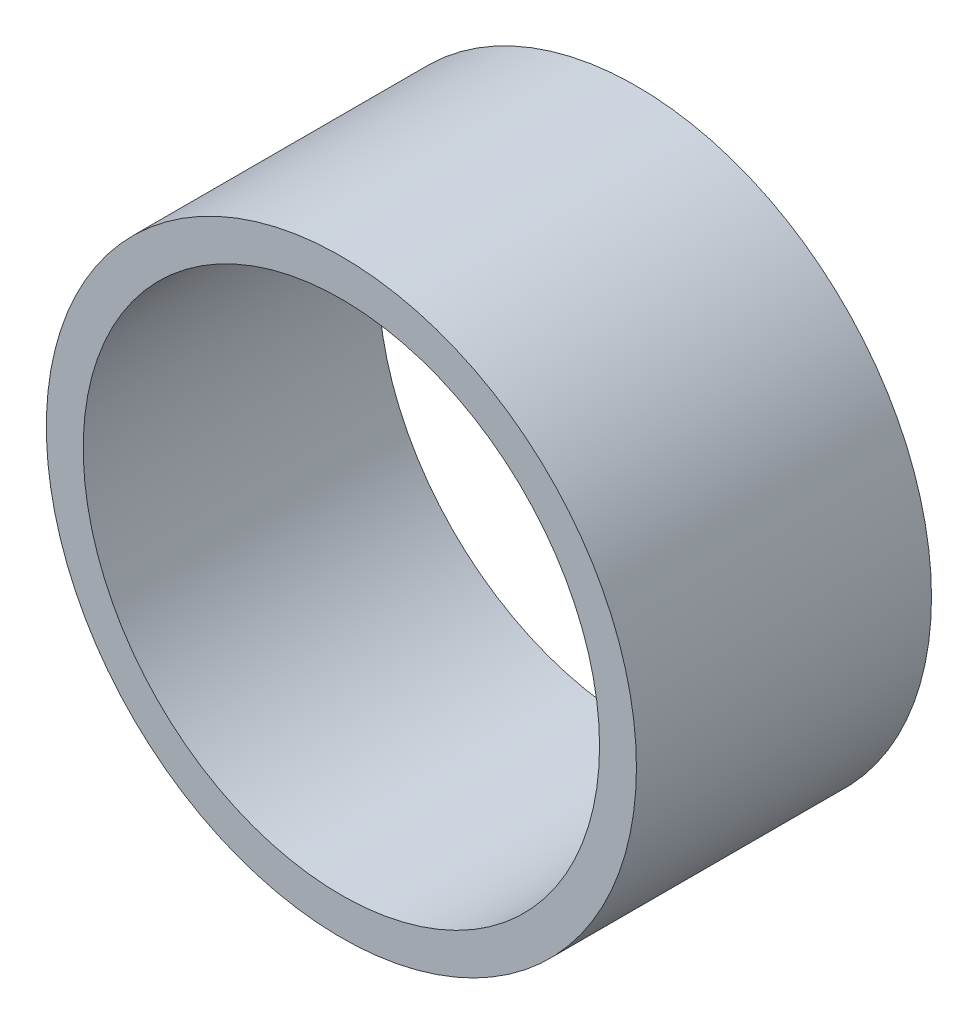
ISO-10303-21;
HEADER;
FILE_DESCRIPTION(('STEP AP214'),'2;1');
FILE_NAME('part.step','',(''),(''),'','','');
FILE_SCHEMA(('AUTOMOTIVE_DESIGN { 1 0 10303 214 1 1 1 1 }'));
ENDSEC;
DATA;
#1=APPLICATION_CONTEXT('core data for automotive mechanical design processes');
#2=APPLICATION_PROTOCOL_DEFINITION('international standard','automotive_design',2000,#1);
#3=PRODUCT_CONTEXT('',#1,'mechanical');
#4=PRODUCT('Part','Part','',(#3));
#5=PRODUCT_RELATED_PRODUCT_CATEGORY('part','',(#4));
#6=PRODUCT_DEFINITION_FORMATION('','',#4);
#7=PRODUCT_DEFINITION_CONTEXT('part definition',#1,'design');
#8=PRODUCT_DEFINITION('design','',#6,#7);
#9=PRODUCT_DEFINITION_SHAPE('','',#8);
#10=(LENGTH_UNIT() NAMED_UNIT(*) SI_UNIT(.MILLI.,.METRE.));
#11=(NAMED_UNIT(*) PLANE_ANGLE_UNIT() SI_UNIT($,.RADIAN.));
#12=(NAMED_UNIT(*) SI_UNIT($,.STERADIAN.) SOLID_ANGLE_UNIT());
#13=UNCERTAINTY_MEASURE_WITH_UNIT(LENGTH_MEASURE(1.E-05),#10,'distance_accuracy_value','');
#14=(GEOMETRIC_REPRESENTATION_CONTEXT(3) GLOBAL_UNCERTAINTY_ASSIGNED_CONTEXT((#13)) GLOBAL_UNIT_ASSIGNED_CONTEXT((#10,
#11,#12)) REPRESENTATION_CONTEXT('',''));
#15=CARTESIAN_POINT('',(0.,0.,0.));
#16=DIRECTION('',(0.,0.,1.));
#17=DIRECTION('',(1.,0.,0.));
#18=AXIS2_PLACEMENT_3D('',#15,#16,#17);
#19=CARTESIAN_POINT('',(0.,0.,25.4));
#20=DIRECTION('',(0.,0.,1.));
#21=DIRECTION('',(1.,0.,0.));
#22=AXIS2_PLACEMENT_3D('',#19,#20,#21);
#23=PLANE('',#22);
#24=CARTESIAN_POINT('',(0.,0.,25.4));
#25=DIRECTION('',(0.,0.,1.));
#26=DIRECTION('',(1.,0.,0.));
#27=AXIS2_PLACEMENT_3D('',#24,#25,#26);
#28=CIRCLE('',#27,50.8);
#29=CARTESIAN_POINT('',(50.8,0.,25.4));
#30=VERTEX_POINT('',#29);
#31=EDGE_CURVE('E10',#30,#30,#28,.T.);
#32=ORIENTED_EDGE('',*,*,#31,.T.);
#33=EDGE_LOOP('',(#32));
#34=FACE_BOUND('',#33,.T.);
#35=CARTESIAN_POINT('',(0.,0.,25.4));
#36=DIRECTION('',(0.,0.,1.));
#37=DIRECTION('',(1.,0.,0.));
#38=AXIS2_PLACEMENT_3D('',#35,#36,#37);
#39=CIRCLE('',#38,44.45);
#40=CARTESIAN_POINT('',(44.45,0.,25.4));
#41=VERTEX_POINT('',#40);
#42=EDGE_CURVE('E46',#41,#41,#39,.T.);
#43=ORIENTED_EDGE('',*,*,#42,.F.);
#44=EDGE_LOOP('',(#43));
#45=FACE_BOUND('',#44,.T.);
#46=ADVANCED_FACE('F35',(#34,#45),#23,.T.);
#47=CARTESIAN_POINT('',(0.,0.,-25.4));
#48=DIRECTION('',(0.,0.,1.));
#49=DIRECTION('',(1.,0.,0.));
#50=AXIS2_PLACEMENT_3D('',#47,#48,#49);
#51=PLANE('',#50);
#52=CARTESIAN_POINT('',(0.,0.,-25.4));
#53=DIRECTION('',(0.,0.,1.));
#54=DIRECTION('',(1.,0.,0.));
#55=AXIS2_PLACEMENT_3D('',#52,#53,#54);
#56=CIRCLE('',#55,50.8);
#57=CARTESIAN_POINT('',(50.8,0.,-25.4));
#58=VERTEX_POINT('',#57);
#59=EDGE_CURVE('E42',#58,#58,#56,.T.);
#60=ORIENTED_EDGE('',*,*,#59,.F.);
#61=EDGE_LOOP('',(#60));
#62=FACE_BOUND('',#61,.T.);
#63=CARTESIAN_POINT('',(0.,0.,-25.4));
#64=DIRECTION('',(0.,0.,1.));
#65=DIRECTION('',(1.,0.,0.));
#66=AXIS2_PLACEMENT_3D('',#63,#64,#65);
#67=CIRCLE('',#66,44.45);
#68=CARTESIAN_POINT('',(44.45,0.,-25.4));
#69=VERTEX_POINT('',#68);
#70=EDGE_CURVE('E50',#69,#69,#67,.T.);
#71=ORIENTED_EDGE('',*,*,#70,.T.);
#72=EDGE_LOOP('',(#71));
#73=FACE_BOUND('',#72,.T.);
#74=ADVANCED_FACE('F56',(#62,#73),#51,.F.);
#75=CARTESIAN_POINT('',(0.,0.,25.4));
#76=DIRECTION('',(0.,0.,-1.));
#77=DIRECTION('',(-1.,0.,0.));
#78=AXIS2_PLACEMENT_3D('',#75,#76,#77);
#79=CYLINDRICAL_SURFACE('',#78,50.8);
#80=ORIENTED_EDGE('',*,*,#31,.F.);
#81=EDGE_LOOP('',(#80));
#82=FACE_BOUND('',#81,.T.);
#83=ORIENTED_EDGE('',*,*,#59,.T.);
#84=EDGE_LOOP('',(#83));
#85=FACE_BOUND('',#84,.T.);
#86=ADVANCED_FACE('F37',(#82,#85),#79,.T.);
#87=CARTESIAN_POINT('',(0.,0.,25.4));
#88=DIRECTION('',(0.,0.,-1.));
#89=DIRECTION('',(-1.,0.,0.));
#90=AXIS2_PLACEMENT_3D('',#87,#88,#89);
#91=CYLINDRICAL_SURFACE('',#90,44.45);
#92=ORIENTED_EDGE('',*,*,#42,.T.);
#93=EDGE_LOOP('',(#92));
#94=FACE_BOUND('',#93,.T.);
#95=ORIENTED_EDGE('',*,*,#70,.F.);
#96=EDGE_LOOP('',(#95));
#97=FACE_BOUND('',#96,.T.);
#98=ADVANCED_FACE('F58',(#94,#97),#91,.F.);
#99=CLOSED_SHELL('',(#46,#74,#86,#98));
#100=MANIFOLD_SOLID_BREP('B2',#99);
#101=ADVANCED_BREP_SHAPE_REPRESENTATION('',(#18,#100),#14);
#102=SHAPE_DEFINITION_REPRESENTATION(#9,#101);
ENDSEC;
END-ISO-10303-21;
